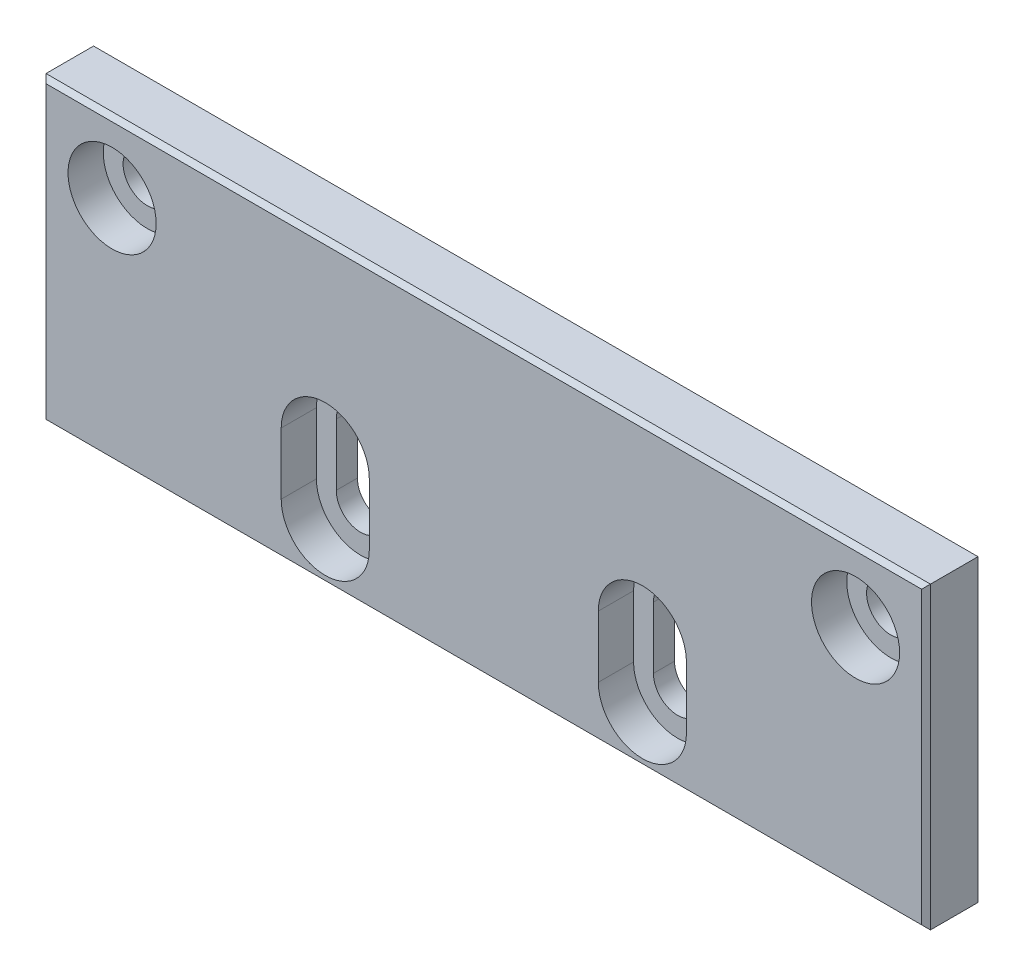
from build123d import *

# Parameters (mm, degrees)
ESQUISSE1_W                                     = 100.4
ESQUISSE1_H                                     = 34
EXTRUSION1_DEPTH                                = 6.4
CHANFREIN1_SIZE                                 = 0.5
CHAMBRAGE_POUR_VIS_T_TE_CYLINDRIQUE_D           = 5.5
CHAMBRAGE_POUR_VIS_T_TE_CYLINDRIQUE_CBORE_D     = 10
CHAMBRAGE_POUR_VIS_T_TE_CYLINDRIQUE_CBORE_DEPTH = 4
ENL_V_MAT_EXTRU_1_DEPTH                         = 4
ENL_V_MAT_EXTRU_2_DEPTH                         = 68.535472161


with BuildPart() as part:
    # Esquisse1 → Extrusion1 (new body)
    with BuildSketch(Plane.XY):
        with Locations((0, -28)):
            Rectangle(ESQUISSE1_W, ESQUISSE1_H)
    extrude(amount=EXTRUSION1_DEPTH)

    # Chanfrein1
    chanfrein1_edges = [part.edges().sort_by_distance(p)[0] for p in [
        (-50.2, -28, 6.4),
        (0, -45, 6.4),
        (50.2, -28, 6.4),
        (0, -45, 0),
        (-50.2, -28, 0),
        (0, -11, 0),
        (50.2, -28, 0),
        (0, -11, 6.4),
    ]]
    chamfer(chanfrein1_edges, length=CHANFREIN1_SIZE)

    # Chambrage pour vis _ t_te cylindrique (through all)
    with Locations(Plane.XY.offset(6.4)):
        with Locations((42.2, -19), (-42.2, -19)):
            CounterBoreHole(CHAMBRAGE_POUR_VIS_T_TE_CYLINDRIQUE_D / 2, CHAMBRAGE_POUR_VIS_T_TE_CYLINDRIQUE_CBORE_D / 2, CHAMBRAGE_POUR_VIS_T_TE_CYLINDRIQUE_CBORE_DEPTH)

    # Esquisse4 → Enl_v. mat.-Extru.1 (cut)
    with BuildSketch(Plane.XY.offset(6.4)):
        with BuildLine():
            Line((13, -32), (13, -39))
            ThreePointArc((13, -39), (18, -44), (23, -39))
            Line((23, -39), (23, -32))
            ThreePointArc((23, -32), (18, -27), (13, -32))
        make_face()
        with BuildLine():
            Line((-23, -32), (-23, -39))
            ThreePointArc((-23, -39), (-18, -44), (-13, -39))
            Line((-13, -39), (-13, -32))
            ThreePointArc((-13, -32), (-18, -27), (-23, -32))
        make_face()
    extrude(amount=-ENL_V_MAT_EXTRU_1_DEPTH, mode=Mode.SUBTRACT)

    # Esquisse5 → Enl_v. mat.-Extru.2 (cut, through all)
    with BuildSketch(Plane.XY.offset(2.4)):
        with BuildLine():
            Line((15.25, -32), (15.25, -39))
            ThreePointArc((15.25, -39), (18, -41.75), (20.75, -39))
            Line((20.75, -39), (20.75, -32))
            ThreePointArc((20.75, -32), (18, -29.25), (15.25, -32))
        make_face()
        with BuildLine():
            Line((-20.75, -39), (-20.75, -32))
            ThreePointArc((-20.75, -32), (-18, -29.25), (-15.25, -32))
            Line((-15.25, -32), (-15.25, -39))
            ThreePointArc((-15.25, -39), (-18, -41.75), (-20.75, -39))
        make_face()
    extrude(amount=-ENL_V_MAT_EXTRU_2_DEPTH, mode=Mode.SUBTRACT)


solid = part.part
